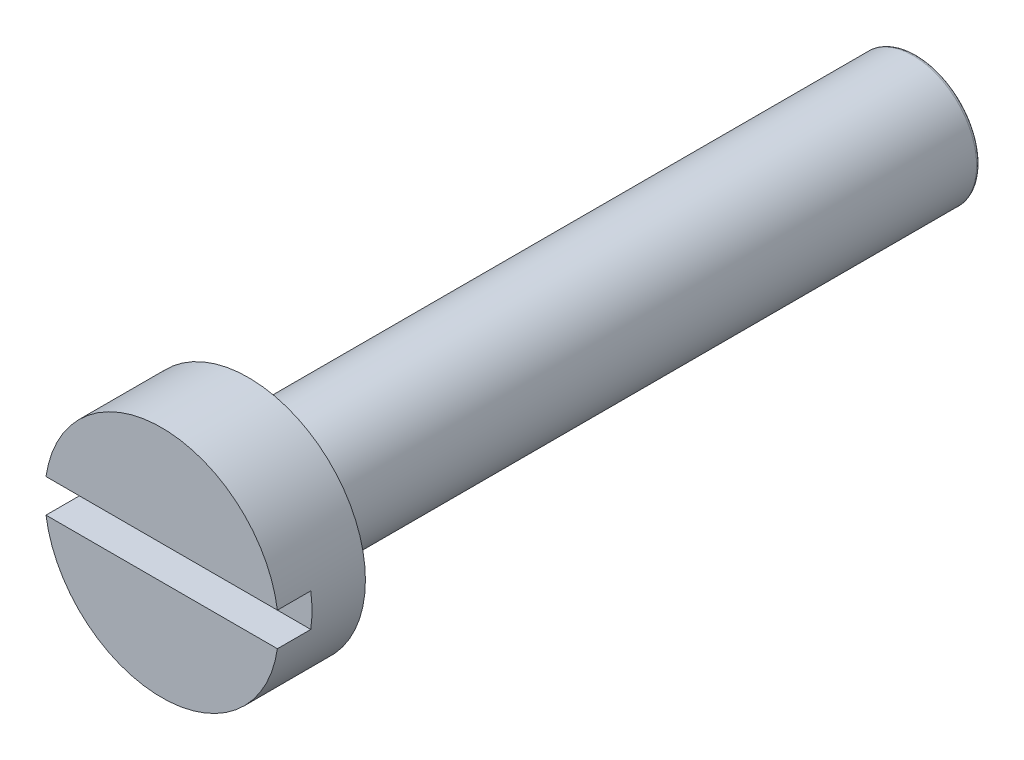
from build123d import *

# Parameters (mm, degrees)
ESQUISSE1_R             = 3.5
EXTRUSION1_DEPTH        = 2.6
ESQUISSE2_W             = 20
ESQUISSE2_H             = 1
ENL_V_MAT_EXTRU_1_DEPTH = 1
ESQUISSE3_R             = 1.9
EXTRUSION2_DEPTH        = 20
CONG_1_R                = 0.1


with BuildPart() as part:
    # Esquisse1 → Extrusion1 (new body)
    with BuildSketch(Plane.XY):
        Circle(ESQUISSE1_R)
    extrude(amount=EXTRUSION1_DEPTH)

    # Esquisse2 → Enl_v. mat.-Extru.1 (cut)
    with BuildSketch(Plane.XY.offset(2.6)):
        Rectangle(ESQUISSE2_W, ESQUISSE2_H)
    extrude(amount=-ENL_V_MAT_EXTRU_1_DEPTH, mode=Mode.SUBTRACT)

    # Esquisse3 → Extrusion2 (add)
    with BuildSketch(Plane(origin=(0, 0, 0), x_dir=(-1, 0, 0), z_dir=(0, 0, -1))):
        with Locations(Location((0, 0, 0), (0, 0, 180))):
            Circle(ESQUISSE3_R)
    extrude(amount=EXTRUSION2_DEPTH)

    # Cong_1
    cong_1_edges = [part.edges().sort_by_distance(p)[0] for p in [
        (-1.9, 0, -20),
    ]]
    fillet(cong_1_edges, radius=CONG_1_R)


solid = part.part
